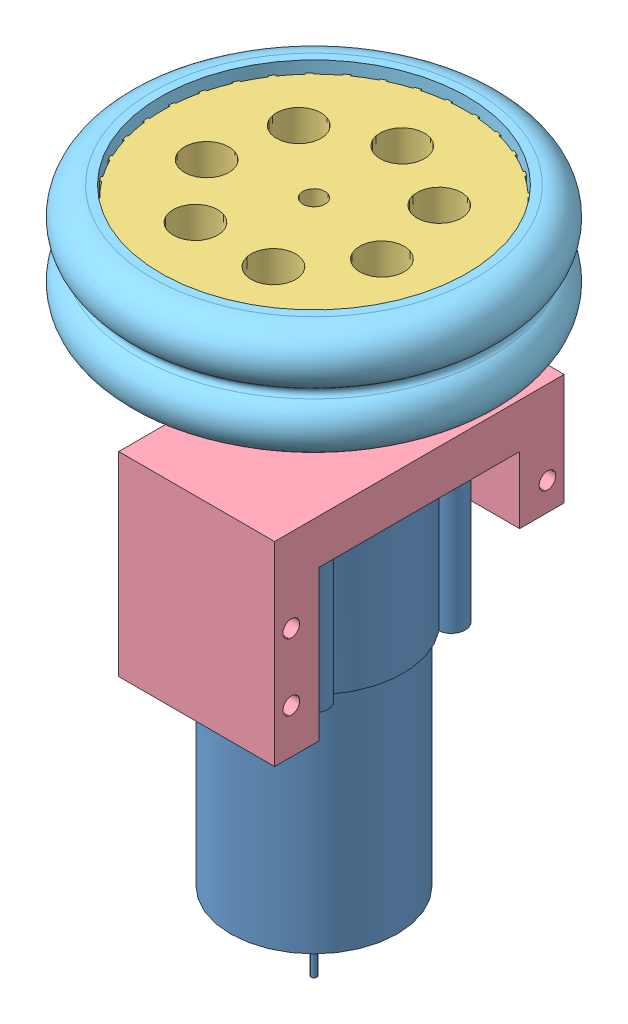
SolidWorks assembly 电机装配.SLDASM, configuration 默认 (file format 9000). Lengths in mm.
Overall size (95.48 123 95.48).
5 component instances, 5 part files, 9 mates.
Components (placement in the parent):
- 冯哈勃电机-1: 冯哈勃电机.SLDPRT [默认] at (-5.8776 -2.9388 110) size (32 110 32)
- 联轴器-1: 联轴器.SLDPRT [默认] at (-5.8776 58.0612 110) x (0.996248 0 0.08655) z (0 -1 0) size (13.86 12 18)
- 3D打印轮子 - 副本-1: 3D打印轮子 - 副本.SLDPRT [默认] at (-5.8776 48.0612 110) x (0.441885 0 0.897072) z (0 1 0) size (56.8 56.8 15)
- 电机座-1: 电机座.SLDPRT [默认] at (-0.9398 32.0612 110) x (0 0 -1) z (0 -1 0) size (52 28 35)
- 4轮子 - 副本-1: 4轮子 - 副本.SLDPRT [默认] at (-5.8776 55.0612 110) x (0.786228 0 -0.617936) z (0 1 0) size (68 68 20)
Mates (geometry in assembly coordinates):
- 同心1: concentric aligned: cylinder of 冯哈勃电机-1 through (-5.8776 52.0612 110) axis (0 -1 0) radius 3; cylinder of 联轴器-1 through (-5.8776 52.0612 110) axis (0 -1 0) radius 3
- 重合1: coincident anti-aligned: plane of 冯哈勃电机-1 through (-5.8776 52.0612 110) normal (0 1 0); plane of 联轴器-1 through (-5.8776 52.0612 110) normal (0 -1 0)
- 同心2: concentric aligned: cylinder of 联轴器-1 through (-5.8776 40.0612 110) axis (0 1 0) radius 5.25; cylinder of 3D打印轮子 - 副本-1 through (-5.8776 45.8693 110) axis (0 1 0) radius 28.4
- 重合2: coincident anti-aligned: plane of 联轴器-1 through (-5.8776 58.0612 110) normal (0 1 0); plane of 3D打印轮子 - 副本-1 through (-5.8776 58.0612 110) normal (0 -1 0)
- 同心3: concentric aligned: cylinder of 联轴器-1 through (-5.8776 40.0612 110) axis (0 1 0) radius 5.25; cylinder of 电机座-1 through (-5.8776 24.0612 110) axis (0 1 0) radius 8.5
- 同心4: concentric anti-aligned: cylinder of 冯哈勃电机-1 through (6.2467 24.0612 110) axis (0 -1 0) radius 1.5; cylinder of 电机座-1 through (6.2467 24.0612 110) axis (0 1 0) radius 1.5
- 重合3: coincident anti-aligned: plane of 冯哈勃电机-1 through (-5.8776 24.0612 110) normal (0 1 0); plane of 电机座-1 through (-0.9398 24.0612 110) normal (0 -1 0)
- 同心5: concentric anti-aligned: cylinder of 3D打印轮子 - 副本-1 through (-5.8776 45.8693 110) axis (0 1 0) radius 28.4; cylinder of 4轮子 - 副本-1 through (-5.8776 100.0612 110) axis (0 -1 0) radius 27.5
- 距离1: distance = 2 mm aligned: plane of 3D打印轮子 - 副本-1 through (-5.8776 63.0612 110) normal (0 1 0); plane of 4轮子 - 副本-1 through (13.7781 65.0612 94.5516) normal (0 1 0)
